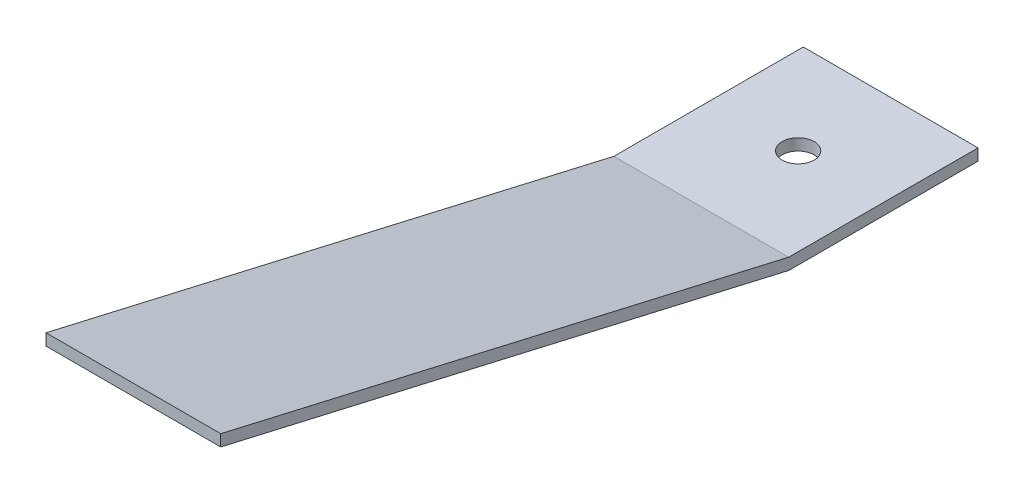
from build123d import *

# Parameters (mm, degrees)
SKETCH1_W           = 12
SKETCH1_H           = 13
BOSS_EXTRUDE1_DEPTH = 0.79375
BOSS_EXTRUDE2_DEPTH = 12
SKETCH3_R           = 1.1
CUT_EXTRUDE1_DEPTH  = 47.768787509


with BuildPart() as part:
    # Sketch1 → Boss-Extrude1 (new body)
    with BuildSketch(Plane(origin=(0, 0, 0), x_dir=(1, 0, 0), z_dir=(0, 1, 0))):
        Rectangle(SKETCH1_W, SKETCH1_H)
    extrude(amount=BOSS_EXTRUDE1_DEPTH)

    # Sketch2 → Boss-Extrude2 (add)
    with BuildSketch(Plane(origin=(6, 0, 0), x_dir=(0, 0, -1), z_dir=(1, 0, 0))):
        Polygon((-6.5, 0), (-6.5, 0.79375), (-45.5, 9.797609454), (-45.5, 9.003859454), align=None)
    extrude(amount=-BOSS_EXTRUDE2_DEPTH)

    # Sketch3 → Cut-Extrude1 (cut, through all)
    with BuildSketch(Plane(origin=(0, 0.79375, 0), x_dir=(1, 0, 0), z_dir=(0, 1, 0))):
        with Locations(Location((0, 0.15, 0), (0, 0, 270))):
            Circle(SKETCH3_R)
    extrude(amount=-CUT_EXTRUDE1_DEPTH, mode=Mode.SUBTRACT)


solid = part.part
